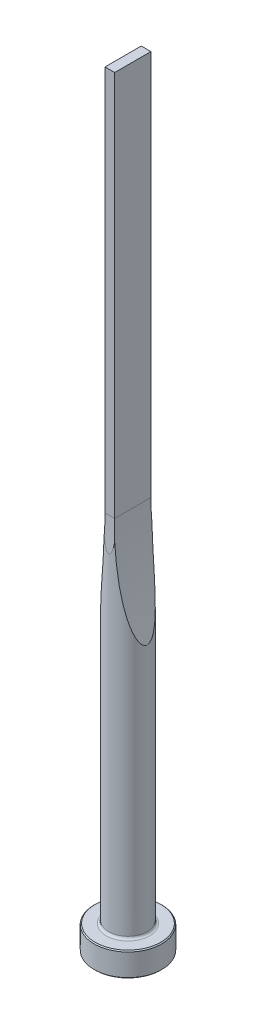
from build123d import *

# Parameters (mm, degrees)
CUT_EXTRUDE1_DEPTH = 5
CUT_EXTRUDE2_DEPTH = 5


with BuildPart() as part:
    # Sketch1 → Revolve1 (revolve)
    with BuildSketch(Plane.XY, mode=Mode.PRIVATE) as revolve1_sk:
        with BuildLine():
            Line((0, 0), (6.8, 0))
            Line((6.8, 0), (7, 0.2))
            Line((7, 0.2), (7, 4.8))
            Line((7, 4.8), (6.8, 5))
            Line((6.8, 5), (4.5, 5))
            ThreePointArc((4.5, 5), (4.146446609, 5.146446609), (4, 5.5))
            Line((4, 5.5), (4, 160))
            Line((4, 160), (0, 160))
            Line((0, 160), (0, 0))
        make_face()
    revolve(revolve1_sk.sketch.rotate(Axis((0, 160, 0), (0, -1, 0)), 180), axis=Axis((0, 160, 0), (0, -1, 0)))

    # Sketch2 → Cut-Extrude1 (cut, symmetric)
    with BuildSketch(Plane.XY):
        with BuildLine():
            Line((1, 160), (1, 80))
            ThreePointArc((1, 80), (1.753151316, 68.381049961), (4, 56.956562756))
            Line((4, 56.956562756), (4, 160))
            Line((4, 160), (1, 160))
        make_face()
        with BuildLine():
            Line((-1, 160), (-1, 80))
            ThreePointArc((-1, 80), (-1.753151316, 68.381049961), (-4, 56.956562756))
            Line((-4, 56.956562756), (-4, 160))
            Line((-4, 160), (-1, 160))
        make_face()
    extrude(amount=CUT_EXTRUDE1_DEPTH, both=True, mode=Mode.SUBTRACT)

    # Sketch3 → Cut-Extrude2 (cut, symmetric)
    with BuildSketch(Plane(origin=(0, 0, 0), x_dir=(0, 0, -1), z_dir=(1, 0, 0))):
        with BuildLine():
            Line((3.75, 160), (3.75, 80))
            ThreePointArc((3.75, 80), (3.812521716, 76.645898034), (4, 73.296456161))
            Line((4, 73.296456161), (4, 160))
            Line((4, 160), (3.75, 160))
        make_face()
        with BuildLine():
            Line((-3.75, 160), (-3.75, 80))
            ThreePointArc((-3.75, 80), (-3.812521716, 76.645898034), (-4, 73.296456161))
            Line((-4, 73.296456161), (-4, 160))
            Line((-4, 160), (-3.75, 160))
        make_face()
    extrude(amount=CUT_EXTRUDE2_DEPTH, both=True, mode=Mode.SUBTRACT)


solid = part.part
